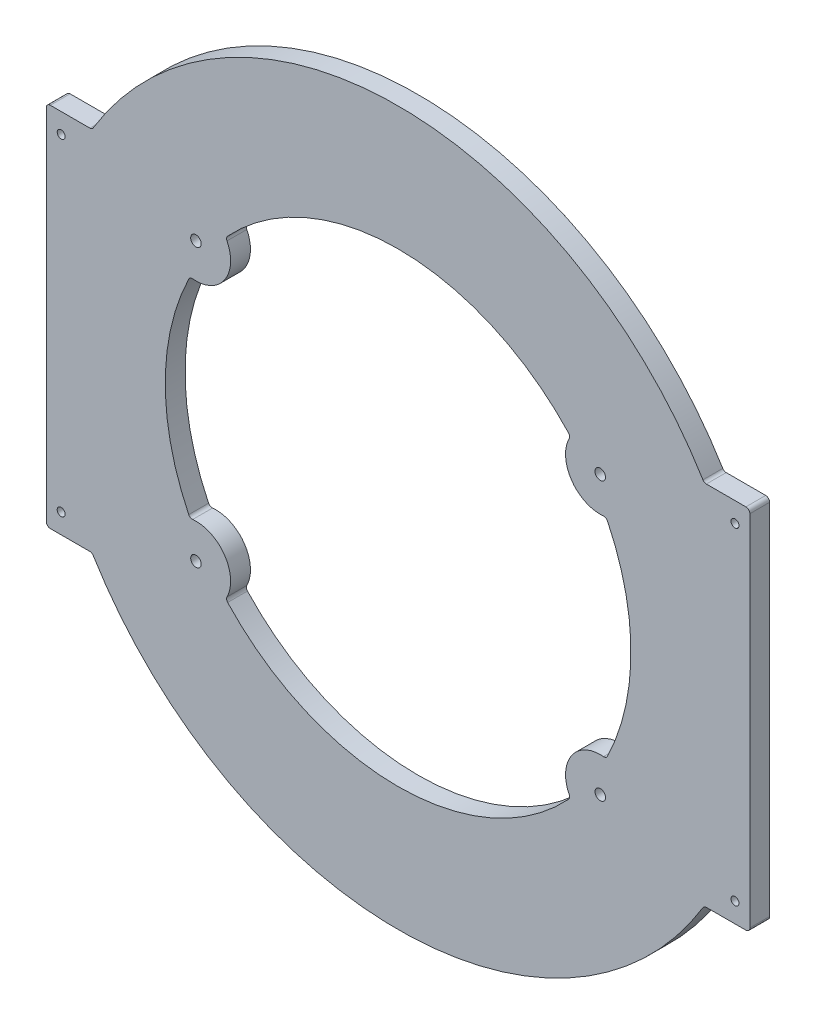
from build123d import *

# Parameters (mm, degrees)
SKETCH1_R               = 228.6
SKETCH1_R_2             = 149.225
BOSS_EXTRUDE1_DEPTH     = 12.7
F_1_4_CLEARANCE_HOLE1_D = 6.7564
BOSS_EXTRUDE2_START     = -12.7
SKETCH4_R               = 22.225
SKETCH4_R_2             = 3.3782
BOSS_EXTRUDE2_DEPTH     = 12.7
SKETCH5_W               = 59.416046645
SKETCH5_H               = 234.95
BOSS_EXTRUDE3_DEPTH     = 12.7
SKETCH6_W               = 44.903945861
SKETCH6_H               = 234.998044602
CUT_EXTRUDE1_DEPTH      = 324.538575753
FILLET1_R               = 2.54
F_10_CLEARANCE_HOLE1_D  = 5.1054


with BuildPart() as part:
    # Sketch1 → Boss-Extrude1 (new body)
    with BuildSketch(Plane.XY):
        Circle(SKETCH1_R)
        Circle(SKETCH1_R_2, mode=Mode.SUBTRACT)
    extrude(amount=BOSS_EXTRUDE1_DEPTH)

    # 1_4 Clearance Hole1 (through all)
    with Locations(Plane.XY.offset(12.7)):
        with Locations((-129.54, 88.9), (-129.54, -88.9), (129.54, -88.9), (129.54, 88.9)):
            Hole(F_1_4_CLEARANCE_HOLE1_D / 2)

    # Sketch4 → Boss-Extrude2 (add)
    # profile 1 of 4: a face of its own
    with BuildSketch(Plane.XY.offset(12.7).offset(BOSS_EXTRUDE2_START)):
        with Locations((-129.54, 88.9)):
            Circle(SKETCH4_R)
        with Locations((-129.54, 88.9)):
            Circle(SKETCH4_R_2, mode=Mode.SUBTRACT)
    # profile 2 of 4: a face of its own
    with BuildSketch(Plane.XY.offset(12.7).offset(BOSS_EXTRUDE2_START)):
        with Locations((-129.54, -88.9)):
            Circle(SKETCH4_R)
        with Locations((-129.54, -88.9)):
            Circle(SKETCH4_R_2, mode=Mode.SUBTRACT)
    # profile 3 of 4: a face of its own
    with BuildSketch(Plane.XY.offset(12.7).offset(BOSS_EXTRUDE2_START)):
        with Locations((129.54, -88.9)):
            Circle(SKETCH4_R)
        with Locations((129.54, -88.9)):
            Circle(SKETCH4_R_2, mode=Mode.SUBTRACT)
    # profile 4 of 4: a face of its own
    with BuildSketch(Plane.XY.offset(12.7).offset(BOSS_EXTRUDE2_START)):
        with Locations((129.54, 88.9)):
            Circle(SKETCH4_R)
        with Locations((129.54, 88.9)):
            Circle(SKETCH4_R_2, mode=Mode.SUBTRACT)
    extrude(amount=BOSS_EXTRUDE2_DEPTH)

    # Sketch5 → Boss-Extrude3 (add)
    with BuildSketch(Plane.XY.offset(12.7)):
        with Locations((195.716976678, 0)):
            Rectangle(SKETCH5_W, SKETCH5_H)
    boss_extrude3 = extrude(amount=-BOSS_EXTRUDE3_DEPTH)

    # Sketch6 → Cut-Extrude1 (cut, through all)
    with BuildSketch(Plane.XY.offset(12.7)):
        with Locations((247.876972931, -0.024022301)):
            Rectangle(SKETCH6_W, SKETCH6_H)
    cut_extrude1 = extrude(amount=-CUT_EXTRUDE1_DEPTH, mode=Mode.SUBTRACT)

    # Mirror1: Boss-Extrude3, Cut-Extrude1 across plane
    add(boss_extrude3.mirror(Plane(origin=(0, 0, 0), x_dir=(0, 0, 1), z_dir=(1, 0, 0))))
    add(cut_extrude1.mirror(Plane(origin=(0, 0, 0), x_dir=(0, 0, 1), z_dir=(1, 0, 0))), mode=Mode.SUBTRACT)

    # Fillet1
    fillet1_edges = [part.edges().sort_by_distance(p)[0] for p in [
        (196.106053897, 117.475, 6.35),
        (196.106053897, -117.475, 6.35),
        (225.425, 117.475, 6.35),
        (225.425, -117.475, 6.35),
        (-196.106053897, 117.475, 6.35),
        (-196.106053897, -117.475, 6.35),
        (-225.425, 117.475, 6.35),
        (-225.425, -117.475, 6.35),
        (-133.337381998, 67.001814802, 6.35),
        (-110.472743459, 100.318859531, 6.35),
        (-110.472743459, -100.318859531, 6.35),
        (-133.337381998, -67.001814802, 6.35),
        (133.337381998, -67.001814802, 6.35),
        (110.472743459, -100.318859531, 6.35),
        (110.472743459, 100.318859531, 6.35),
        (133.337381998, 67.001814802, 6.35),
    ]]
    fillet(fillet1_edges, radius=FILLET1_R)

    # 10 Clearance Hole1 (through all)
    with Locations(Plane.XY.offset(12.7)):
        with Locations((215.9, 104.775), (215.9, -104.775), (-215.9, -104.775), (-215.9, 104.775)):
            Hole(F_10_CLEARANCE_HOLE1_D / 2)


solid = part.part
